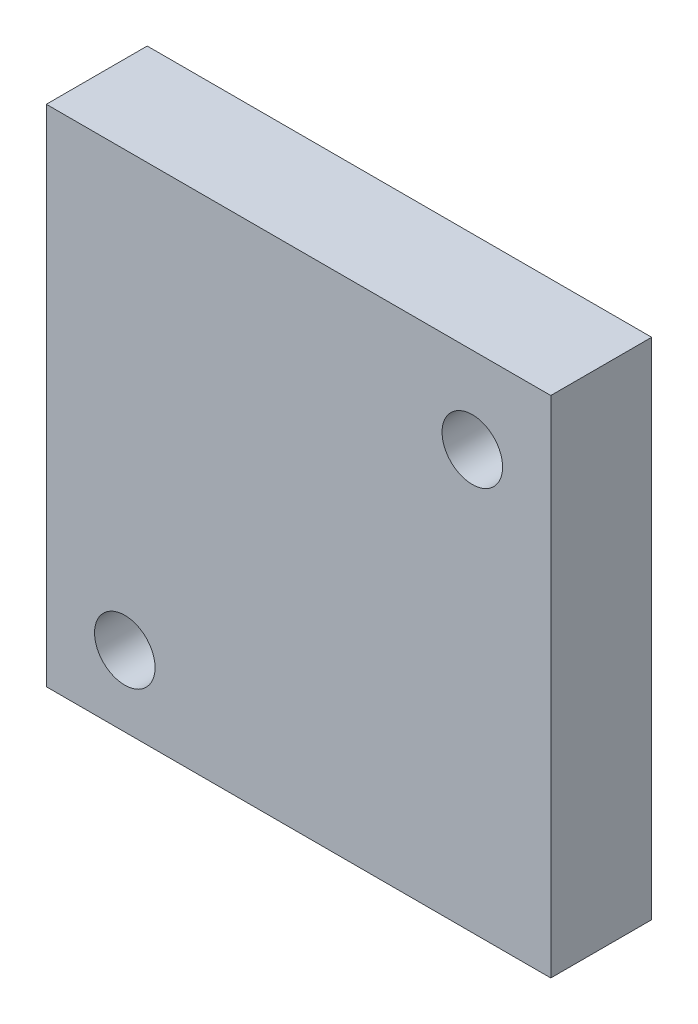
ISO-10303-21;
HEADER;
FILE_DESCRIPTION(('STEP AP214'),'2;1');
FILE_NAME('part.step','',(''),(''),'','','');
FILE_SCHEMA(('AUTOMOTIVE_DESIGN { 1 0 10303 214 1 1 1 1 }'));
ENDSEC;
DATA;
#1=APPLICATION_CONTEXT('core data for automotive mechanical design processes');
#2=APPLICATION_PROTOCOL_DEFINITION('international standard','automotive_design',2000,#1);
#3=PRODUCT_CONTEXT('',#1,'mechanical');
#4=PRODUCT('Part','Part','',(#3));
#5=PRODUCT_RELATED_PRODUCT_CATEGORY('part','',(#4));
#6=PRODUCT_DEFINITION_FORMATION('','',#4);
#7=PRODUCT_DEFINITION_CONTEXT('part definition',#1,'design');
#8=PRODUCT_DEFINITION('design','',#6,#7);
#9=PRODUCT_DEFINITION_SHAPE('','',#8);
#10=(LENGTH_UNIT() NAMED_UNIT(*) SI_UNIT(.MILLI.,.METRE.));
#11=(NAMED_UNIT(*) PLANE_ANGLE_UNIT() SI_UNIT($,.RADIAN.));
#12=(NAMED_UNIT(*) SI_UNIT($,.STERADIAN.) SOLID_ANGLE_UNIT());
#13=UNCERTAINTY_MEASURE_WITH_UNIT(LENGTH_MEASURE(1.E-05),#10,'distance_accuracy_value','');
#14=(GEOMETRIC_REPRESENTATION_CONTEXT(3) GLOBAL_UNCERTAINTY_ASSIGNED_CONTEXT((#13)) GLOBAL_UNIT_ASSIGNED_CONTEXT((#10,
#11,#12)) REPRESENTATION_CONTEXT('',''));
#15=CARTESIAN_POINT('',(0.,0.,0.));
#16=DIRECTION('',(0.,0.,1.));
#17=DIRECTION('',(1.,0.,0.));
#18=AXIS2_PLACEMENT_3D('',#15,#16,#17);
#19=CARTESIAN_POINT('',(-50.,50.,20.));
#20=DIRECTION('',(1.,0.,0.));
#21=DIRECTION('',(0.,1.,0.));
#22=AXIS2_PLACEMENT_3D('',#19,#20,#21);
#23=PLANE('',#22);
#24=DIRECTION('',(0.,-1.,0.));
#25=VECTOR('',#24,1.);
#26=CARTESIAN_POINT('',(-50.,50.,0.));
#27=LINE('',#26,#25);
#28=CARTESIAN_POINT('',(-50.,50.,0.));
#29=VERTEX_POINT('',#28);
#30=CARTESIAN_POINT('',(-50.,-50.,0.));
#31=VERTEX_POINT('',#30);
#32=EDGE_CURVE('E93',#29,#31,#27,.T.);
#33=ORIENTED_EDGE('',*,*,#32,.T.);
#34=DIRECTION('',(0.,0.,-1.));
#35=VECTOR('',#34,1.);
#36=CARTESIAN_POINT('',(-50.,-50.,20.));
#37=LINE('',#36,#35);
#38=CARTESIAN_POINT('',(-50.,-50.,20.));
#39=VERTEX_POINT('',#38);
#40=EDGE_CURVE('E11',#39,#31,#37,.T.);
#41=ORIENTED_EDGE('',*,*,#40,.F.);
#42=DIRECTION('',(0.,-1.,0.));
#43=VECTOR('',#42,1.);
#44=CARTESIAN_POINT('',(-50.,50.,20.));
#45=LINE('',#44,#43);
#46=CARTESIAN_POINT('',(-50.,50.,20.));
#47=VERTEX_POINT('',#46);
#48=EDGE_CURVE('E81',#47,#39,#45,.T.);
#49=ORIENTED_EDGE('',*,*,#48,.F.);
#50=DIRECTION('',(0.,0.,-1.));
#51=VECTOR('',#50,1.);
#52=CARTESIAN_POINT('',(-50.,50.,20.));
#53=LINE('',#52,#51);
#54=EDGE_CURVE('E89',#47,#29,#53,.T.);
#55=ORIENTED_EDGE('',*,*,#54,.T.);
#56=EDGE_LOOP('',(#33,#41,#49,#55));
#57=FACE_BOUND('',#56,.T.);
#58=ADVANCED_FACE('F30',(#57),#23,.F.);
#59=CARTESIAN_POINT('',(-50.,-50.,20.));
#60=DIRECTION('',(0.,1.,0.));
#61=DIRECTION('',(0.,0.,1.));
#62=AXIS2_PLACEMENT_3D('',#59,#60,#61);
#63=PLANE('',#62);
#64=DIRECTION('',(1.,0.,0.));
#65=VECTOR('',#64,1.);
#66=CARTESIAN_POINT('',(-50.,-50.,0.));
#67=LINE('',#66,#65);
#68=CARTESIAN_POINT('',(50.,-50.,0.));
#69=VERTEX_POINT('',#68);
#70=EDGE_CURVE('E85',#31,#69,#67,.T.);
#71=ORIENTED_EDGE('',*,*,#70,.T.);
#72=DIRECTION('',(0.,0.,-1.));
#73=VECTOR('',#72,1.);
#74=CARTESIAN_POINT('',(50.,-50.,20.));
#75=LINE('',#74,#73);
#76=CARTESIAN_POINT('',(50.,-50.,20.));
#77=VERTEX_POINT('',#76);
#78=EDGE_CURVE('E38',#77,#69,#75,.T.);
#79=ORIENTED_EDGE('',*,*,#78,.F.);
#80=DIRECTION('',(1.,0.,0.));
#81=VECTOR('',#80,1.);
#82=CARTESIAN_POINT('',(-50.,-50.,20.));
#83=LINE('',#82,#81);
#84=EDGE_CURVE('E76',#39,#77,#83,.T.);
#85=ORIENTED_EDGE('',*,*,#84,.F.);
#86=ORIENTED_EDGE('',*,*,#40,.T.);
#87=EDGE_LOOP('',(#71,#79,#85,#86));
#88=FACE_BOUND('',#87,.T.);
#89=ADVANCED_FACE('F84',(#88),#63,.F.);
#90=CARTESIAN_POINT('',(50.,50.,20.));
#91=DIRECTION('',(-1.,0.,0.));
#92=DIRECTION('',(0.,-1.,0.));
#93=AXIS2_PLACEMENT_3D('',#90,#91,#92);
#94=PLANE('',#93);
#95=DIRECTION('',(0.,1.,0.));
#96=VECTOR('',#95,1.);
#97=CARTESIAN_POINT('',(50.,50.,0.));
#98=LINE('',#97,#96);
#99=CARTESIAN_POINT('',(50.,50.,0.));
#100=VERTEX_POINT('',#99);
#101=EDGE_CURVE('E63',#69,#100,#98,.T.);
#102=ORIENTED_EDGE('',*,*,#101,.T.);
#103=DIRECTION('',(0.,0.,-1.));
#104=VECTOR('',#103,1.);
#105=CARTESIAN_POINT('',(50.,50.,20.));
#106=LINE('',#105,#104);
#107=CARTESIAN_POINT('',(50.,50.,20.));
#108=VERTEX_POINT('',#107);
#109=EDGE_CURVE('E86',#108,#100,#106,.T.);
#110=ORIENTED_EDGE('',*,*,#109,.F.);
#111=DIRECTION('',(0.,1.,0.));
#112=VECTOR('',#111,1.);
#113=CARTESIAN_POINT('',(50.,50.,20.));
#114=LINE('',#113,#112);
#115=EDGE_CURVE('E79',#77,#108,#114,.T.);
#116=ORIENTED_EDGE('',*,*,#115,.F.);
#117=ORIENTED_EDGE('',*,*,#78,.T.);
#118=EDGE_LOOP('',(#102,#110,#116,#117));
#119=FACE_BOUND('',#118,.T.);
#120=ADVANCED_FACE('F87',(#119),#94,.F.);
#121=CARTESIAN_POINT('',(-50.,50.,20.));
#122=DIRECTION('',(0.,-1.,0.));
#123=DIRECTION('',(0.,0.,-1.));
#124=AXIS2_PLACEMENT_3D('',#121,#122,#123);
#125=PLANE('',#124);
#126=DIRECTION('',(-1.,0.,0.));
#127=VECTOR('',#126,1.);
#128=CARTESIAN_POINT('',(-50.,50.,0.));
#129=LINE('',#128,#127);
#130=EDGE_CURVE('E69',#100,#29,#129,.T.);
#131=ORIENTED_EDGE('',*,*,#130,.T.);
#132=ORIENTED_EDGE('',*,*,#54,.F.);
#133=DIRECTION('',(-1.,0.,0.));
#134=VECTOR('',#133,1.);
#135=CARTESIAN_POINT('',(-50.,50.,20.));
#136=LINE('',#135,#134);
#137=EDGE_CURVE('E46',#108,#47,#136,.T.);
#138=ORIENTED_EDGE('',*,*,#137,.F.);
#139=ORIENTED_EDGE('',*,*,#109,.T.);
#140=EDGE_LOOP('',(#131,#132,#138,#139));
#141=FACE_BOUND('',#140,.T.);
#142=ADVANCED_FACE('F101',(#141),#125,.F.);
#143=CARTESIAN_POINT('',(-50.,-50.,20.));
#144=DIRECTION('',(0.,0.,1.));
#145=DIRECTION('',(1.,0.,0.));
#146=AXIS2_PLACEMENT_3D('',#143,#144,#145);
#147=PLANE('',#146);
#148=CARTESIAN_POINT('',(-34.4450749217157,-35.9477124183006,20.));
#149=DIRECTION('',(0.,0.,1.));
#150=DIRECTION('',(1.,0.,0.));
#151=AXIS2_PLACEMENT_3D('',#148,#149,#150);
#152=CIRCLE('',#151,5.99999999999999);
#153=CARTESIAN_POINT('',(-28.4450749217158,-35.9477124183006,20.));
#154=VERTEX_POINT('',#153);
#155=EDGE_CURVE('E112',#154,#154,#152,.T.);
#156=ORIENTED_EDGE('',*,*,#155,.F.);
#157=EDGE_LOOP('',(#156));
#158=FACE_BOUND('',#157,.T.);
#159=CARTESIAN_POINT('',(34.4450749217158,32.9424374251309,20.));
#160=DIRECTION('',(0.,0.,1.));
#161=DIRECTION('',(1.,0.,0.));
#162=AXIS2_PLACEMENT_3D('',#159,#160,#161);
#163=CIRCLE('',#162,5.99999999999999);
#164=CARTESIAN_POINT('',(40.4450749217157,32.9424374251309,20.));
#165=VERTEX_POINT('',#164);
#166=EDGE_CURVE('E96',#165,#165,#163,.T.);
#167=ORIENTED_EDGE('',*,*,#166,.F.);
#168=EDGE_LOOP('',(#167));
#169=FACE_BOUND('',#168,.T.);
#170=ORIENTED_EDGE('',*,*,#48,.T.);
#171=ORIENTED_EDGE('',*,*,#84,.T.);
#172=ORIENTED_EDGE('',*,*,#115,.T.);
#173=ORIENTED_EDGE('',*,*,#137,.T.);
#174=EDGE_LOOP('',(#170,#171,#172,#173));
#175=FACE_BOUND('',#174,.T.);
#176=ADVANCED_FACE('F77',(#158,#169,#175),#147,.T.);
#177=CARTESIAN_POINT('',(-50.,-50.,0.));
#178=DIRECTION('',(0.,0.,1.));
#179=DIRECTION('',(1.,0.,0.));
#180=AXIS2_PLACEMENT_3D('',#177,#178,#179);
#181=PLANE('',#180);
#182=CARTESIAN_POINT('',(-34.4450749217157,-35.9477124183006,0.));
#183=DIRECTION('',(0.,0.,1.));
#184=DIRECTION('',(1.,0.,0.));
#185=AXIS2_PLACEMENT_3D('',#182,#183,#184);
#186=CIRCLE('',#185,6.);
#187=CARTESIAN_POINT('',(-28.4450749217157,-35.9477124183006,0.));
#188=VERTEX_POINT('',#187);
#189=EDGE_CURVE('E115',#188,#188,#186,.T.);
#190=ORIENTED_EDGE('',*,*,#189,.T.);
#191=EDGE_LOOP('',(#190));
#192=FACE_BOUND('',#191,.T.);
#193=CARTESIAN_POINT('',(34.4450749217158,32.9424374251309,0.));
#194=DIRECTION('',(0.,0.,1.));
#195=DIRECTION('',(1.,0.,0.));
#196=AXIS2_PLACEMENT_3D('',#193,#194,#195);
#197=CIRCLE('',#196,6.);
#198=CARTESIAN_POINT('',(40.4450749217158,32.9424374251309,0.));
#199=VERTEX_POINT('',#198);
#200=EDGE_CURVE('E109',#199,#199,#197,.T.);
#201=ORIENTED_EDGE('',*,*,#200,.T.);
#202=EDGE_LOOP('',(#201));
#203=FACE_BOUND('',#202,.T.);
#204=ORIENTED_EDGE('',*,*,#32,.F.);
#205=ORIENTED_EDGE('',*,*,#130,.F.);
#206=ORIENTED_EDGE('',*,*,#101,.F.);
#207=ORIENTED_EDGE('',*,*,#70,.F.);
#208=EDGE_LOOP('',(#204,#205,#206,#207));
#209=FACE_BOUND('',#208,.T.);
#210=ADVANCED_FACE('F104',(#192,#203,#209),#181,.F.);
#211=CARTESIAN_POINT('',(34.4450749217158,32.9424374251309,20.));
#212=DIRECTION('',(0.,0.,1.));
#213=DIRECTION('',(1.,0.,0.));
#214=AXIS2_PLACEMENT_3D('',#211,#212,#213);
#215=CYLINDRICAL_SURFACE('',#214,5.99999999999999);
#216=ORIENTED_EDGE('',*,*,#200,.F.);
#217=EDGE_LOOP('',(#216));
#218=FACE_BOUND('',#217,.T.);
#219=ORIENTED_EDGE('',*,*,#166,.T.);
#220=EDGE_LOOP('',(#219));
#221=FACE_BOUND('',#220,.T.);
#222=ADVANCED_FACE('F124',(#218,#221),#215,.F.);
#223=CARTESIAN_POINT('',(-34.4450749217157,-35.9477124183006,20.));
#224=DIRECTION('',(0.,0.,1.));
#225=DIRECTION('',(1.,0.,0.));
#226=AXIS2_PLACEMENT_3D('',#223,#224,#225);
#227=CYLINDRICAL_SURFACE('',#226,5.99999999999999);
#228=ORIENTED_EDGE('',*,*,#189,.F.);
#229=EDGE_LOOP('',(#228));
#230=FACE_BOUND('',#229,.T.);
#231=ORIENTED_EDGE('',*,*,#155,.T.);
#232=EDGE_LOOP('',(#231));
#233=FACE_BOUND('',#232,.T.);
#234=ADVANCED_FACE('F121',(#230,#233),#227,.F.);
#235=CLOSED_SHELL('',(#58,#89,#120,#142,#176,#210,#222,#234));
#236=MANIFOLD_SOLID_BREP('B2',#235);
#237=ADVANCED_BREP_SHAPE_REPRESENTATION('',(#18,#236),#14);
#238=SHAPE_DEFINITION_REPRESENTATION(#9,#237);
ENDSEC;
END-ISO-10303-21;
